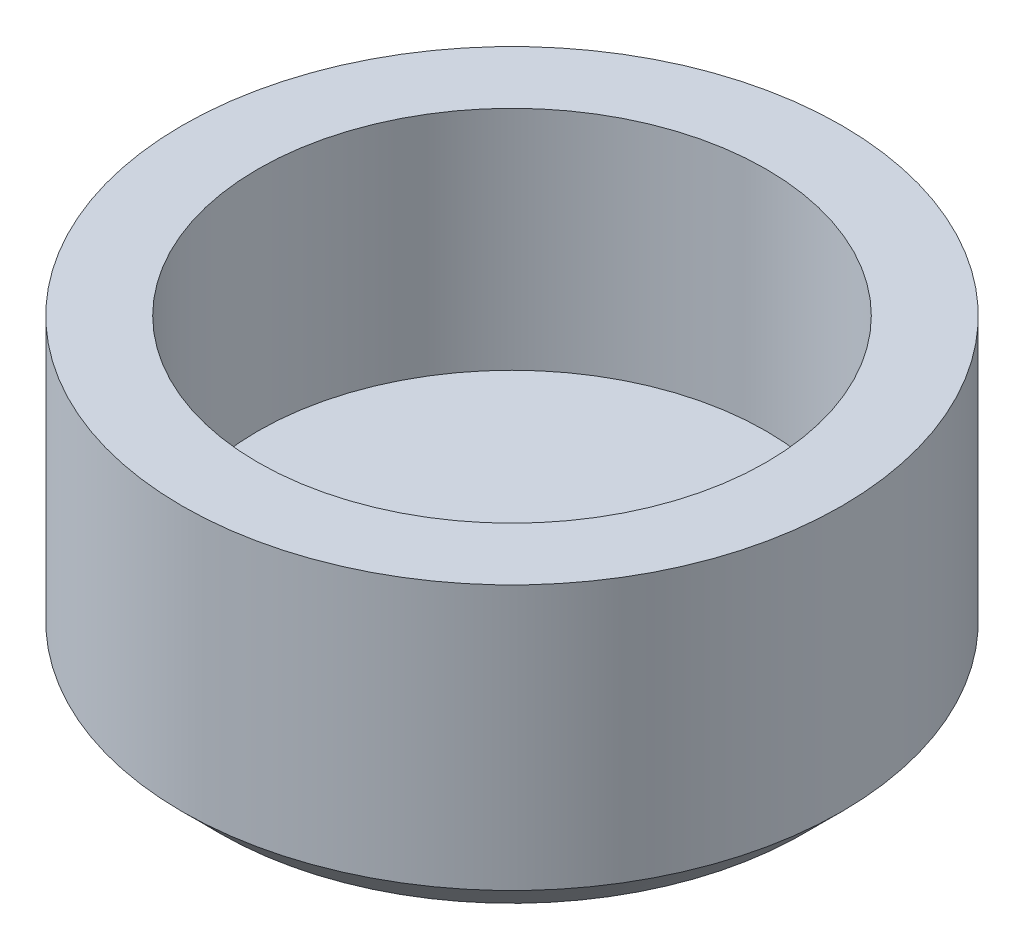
ISO-10303-21;
HEADER;
FILE_DESCRIPTION(('STEP AP214'),'2;1');
FILE_NAME('part.step','',(''),(''),'','','');
FILE_SCHEMA(('AUTOMOTIVE_DESIGN { 1 0 10303 214 1 1 1 1 }'));
ENDSEC;
DATA;
#1=APPLICATION_CONTEXT('core data for automotive mechanical design processes');
#2=APPLICATION_PROTOCOL_DEFINITION('international standard','automotive_design',2000,#1);
#3=PRODUCT_CONTEXT('',#1,'mechanical');
#4=PRODUCT('Part','Part','',(#3));
#5=PRODUCT_RELATED_PRODUCT_CATEGORY('part','',(#4));
#6=PRODUCT_DEFINITION_FORMATION('','',#4);
#7=PRODUCT_DEFINITION_CONTEXT('part definition',#1,'design');
#8=PRODUCT_DEFINITION('design','',#6,#7);
#9=PRODUCT_DEFINITION_SHAPE('','',#8);
#10=(LENGTH_UNIT() NAMED_UNIT(*) SI_UNIT(.MILLI.,.METRE.));
#11=(NAMED_UNIT(*) PLANE_ANGLE_UNIT() SI_UNIT($,.RADIAN.));
#12=(NAMED_UNIT(*) SI_UNIT($,.STERADIAN.) SOLID_ANGLE_UNIT());
#13=UNCERTAINTY_MEASURE_WITH_UNIT(LENGTH_MEASURE(1.E-05),#10,'distance_accuracy_value','');
#14=(GEOMETRIC_REPRESENTATION_CONTEXT(3) GLOBAL_UNCERTAINTY_ASSIGNED_CONTEXT((#13)) GLOBAL_UNIT_ASSIGNED_CONTEXT((#10,
#11,#12)) REPRESENTATION_CONTEXT('',''));
#15=CARTESIAN_POINT('',(0.,0.,0.));
#16=DIRECTION('',(0.,0.,1.));
#17=DIRECTION('',(1.,0.,0.));
#18=AXIS2_PLACEMENT_3D('',#15,#16,#17);
#19=CARTESIAN_POINT('',(10.668,0.,0.));
#20=DIRECTION('',(0.,1.,0.));
#21=DIRECTION('',(0.,0.,1.));
#22=AXIS2_PLACEMENT_3D('',#19,#20,#21);
#23=PLANE('',#22);
#24=CARTESIAN_POINT('',(0.,0.,0.));
#25=DIRECTION('',(0.,-1.,0.));
#26=DIRECTION('',(0.,0.,-1.));
#27=AXIS2_PLACEMENT_3D('',#24,#25,#26);
#28=CIRCLE('',#27,10.668);
#29=CARTESIAN_POINT('',(0.,0.,-10.668));
#30=VERTEX_POINT('',#29);
#31=EDGE_CURVE('E50',#30,#30,#28,.T.);
#32=ORIENTED_EDGE('',*,*,#31,.F.);
#33=EDGE_LOOP('',(#32));
#34=FACE_BOUND('',#33,.T.);
#35=ADVANCED_FACE('F30',(#34),#23,.T.);
#36=CARTESIAN_POINT('',(0.,-3.175,0.));
#37=DIRECTION('',(0.,-1.,0.));
#38=DIRECTION('',(0.,0.,-1.));
#39=AXIS2_PLACEMENT_3D('',#36,#37,#38);
#40=PLANE('',#39);
#41=CARTESIAN_POINT('',(0.,-3.175,0.));
#42=DIRECTION('',(0.,-1.,0.));
#43=DIRECTION('',(0.,0.,-1.));
#44=AXIS2_PLACEMENT_3D('',#41,#42,#43);
#45=CIRCLE('',#44,12.2555);
#46=CARTESIAN_POINT('',(0.,-3.175,-12.2555));
#47=VERTEX_POINT('',#46);
#48=EDGE_CURVE('E37',#47,#47,#45,.T.);
#49=ORIENTED_EDGE('',*,*,#48,.T.);
#50=EDGE_LOOP('',(#49));
#51=FACE_BOUND('',#50,.T.);
#52=ADVANCED_FACE('F58',(#51),#40,.T.);
#53=CARTESIAN_POINT('',(0.,0.,0.));
#54=DIRECTION('',(0.,-1.,0.));
#55=DIRECTION('',(0.,0.,-1.));
#56=AXIS2_PLACEMENT_3D('',#53,#54,#55);
#57=CYLINDRICAL_SURFACE('',#56,13.843);
#58=CARTESIAN_POINT('',(0.,-1.5875,0.));
#59=DIRECTION('',(0.,-1.,0.));
#60=DIRECTION('',(0.,0.,-1.));
#61=AXIS2_PLACEMENT_3D('',#58,#59,#60);
#62=CIRCLE('',#61,13.843);
#63=CARTESIAN_POINT('',(0.,-1.5875,-13.843));
#64=VERTEX_POINT('',#63);
#65=EDGE_CURVE('E10',#64,#64,#62,.F.);
#66=ORIENTED_EDGE('',*,*,#65,.T.);
#67=EDGE_LOOP('',(#66));
#68=FACE_BOUND('',#67,.T.);
#69=CARTESIAN_POINT('',(0.,9.525,0.));
#70=DIRECTION('',(0.,-1.,0.));
#71=DIRECTION('',(0.,0.,-1.));
#72=AXIS2_PLACEMENT_3D('',#69,#70,#71);
#73=CIRCLE('',#72,13.843);
#74=CARTESIAN_POINT('',(0.,9.525,-13.843));
#75=VERTEX_POINT('',#74);
#76=EDGE_CURVE('E41',#75,#75,#73,.T.);
#77=ORIENTED_EDGE('',*,*,#76,.T.);
#78=EDGE_LOOP('',(#77));
#79=FACE_BOUND('',#78,.T.);
#80=ADVANCED_FACE('F62',(#68,#79),#57,.T.);
#81=CARTESIAN_POINT('',(13.843,9.525,0.));
#82=DIRECTION('',(0.,1.,0.));
#83=DIRECTION('',(0.,0.,1.));
#84=AXIS2_PLACEMENT_3D('',#81,#82,#83);
#85=PLANE('',#84);
#86=CARTESIAN_POINT('',(0.,9.525,0.));
#87=DIRECTION('',(0.,-1.,0.));
#88=DIRECTION('',(0.,0.,-1.));
#89=AXIS2_PLACEMENT_3D('',#86,#87,#88);
#90=CIRCLE('',#89,10.668);
#91=CARTESIAN_POINT('',(0.,9.525,-10.668));
#92=VERTEX_POINT('',#91);
#93=EDGE_CURVE('E45',#92,#92,#90,.T.);
#94=ORIENTED_EDGE('',*,*,#93,.T.);
#95=EDGE_LOOP('',(#94));
#96=FACE_BOUND('',#95,.T.);
#97=ORIENTED_EDGE('',*,*,#76,.F.);
#98=EDGE_LOOP('',(#97));
#99=FACE_BOUND('',#98,.T.);
#100=ADVANCED_FACE('F67',(#96,#99),#85,.T.);
#101=CARTESIAN_POINT('',(0.,0.,0.));
#102=DIRECTION('',(0.,-1.,0.));
#103=DIRECTION('',(0.,0.,-1.));
#104=AXIS2_PLACEMENT_3D('',#101,#102,#103);
#105=CYLINDRICAL_SURFACE('',#104,10.668);
#106=ORIENTED_EDGE('',*,*,#31,.T.);
#107=EDGE_LOOP('',(#106));
#108=FACE_BOUND('',#107,.T.);
#109=ORIENTED_EDGE('',*,*,#93,.F.);
#110=EDGE_LOOP('',(#109));
#111=FACE_BOUND('',#110,.T.);
#112=ADVANCED_FACE('F54',(#108,#111),#105,.F.);
#113=CARTESIAN_POINT('',(0.,-3.175,0.));
#114=DIRECTION('',(0.,1.,0.));
#115=DIRECTION('',(0.,0.,1.));
#116=AXIS2_PLACEMENT_3D('',#113,#114,#115);
#117=CONICAL_SURFACE('',#116,12.2555,0.785398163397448);
#118=ORIENTED_EDGE('',*,*,#65,.F.);
#119=EDGE_LOOP('',(#118));
#120=FACE_BOUND('',#119,.T.);
#121=ORIENTED_EDGE('',*,*,#48,.F.);
#122=EDGE_LOOP('',(#121));
#123=FACE_BOUND('',#122,.T.);
#124=ADVANCED_FACE('F32',(#120,#123),#117,.T.);
#125=CLOSED_SHELL('',(#35,#52,#80,#100,#112,#124));
#126=MANIFOLD_SOLID_BREP('B2',#125);
#127=ADVANCED_BREP_SHAPE_REPRESENTATION('',(#18,#126),#14);
#128=SHAPE_DEFINITION_REPRESENTATION(#9,#127);
ENDSEC;
END-ISO-10303-21;
